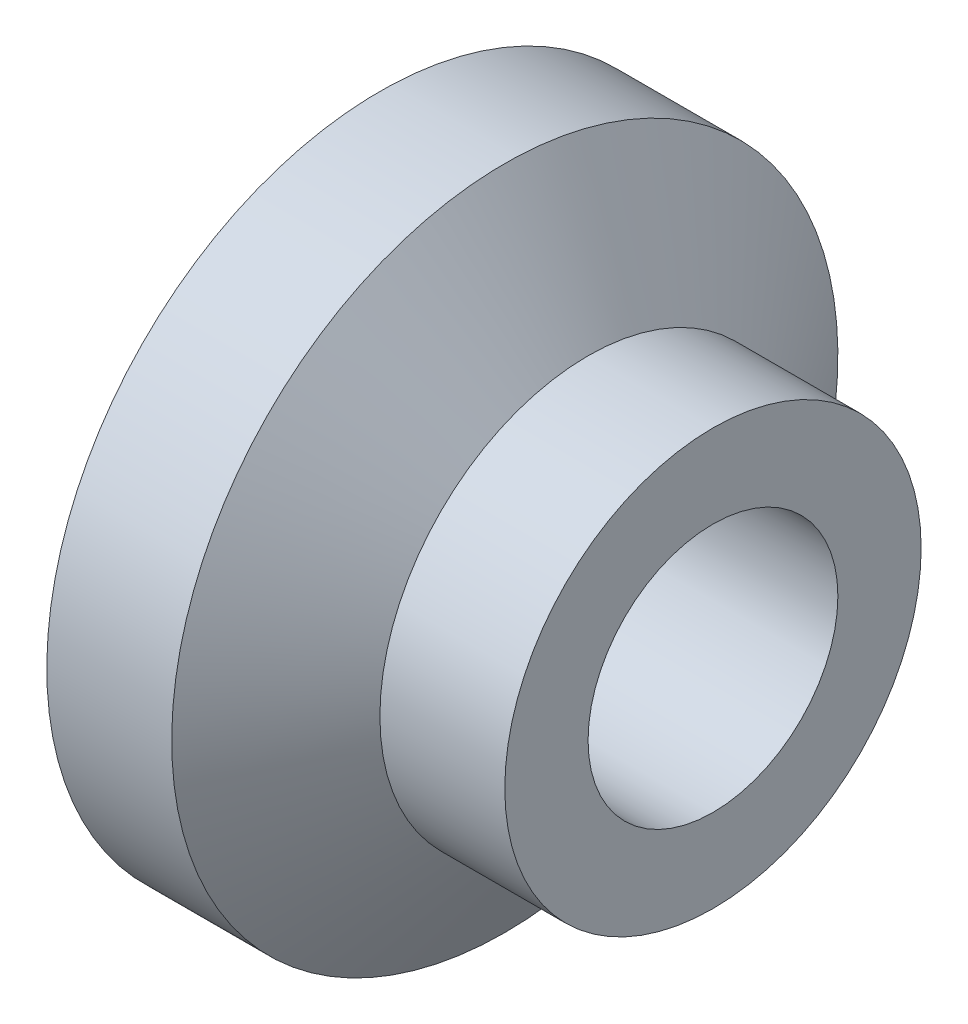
from build123d import *

# Parameters (mm, degrees)
ESQUISSE2_R             = 1.5
ENL_V_MAT_EXTRU_1_DEPTH = 7.92820323


with BuildPart() as part:
    # Esquisse1 → R_volution1 (revolve)
    with BuildSketch(Plane.XY, mode=Mode.PRIVATE) as r_volution1_sk:
        Polygon((0, 0), (0, 4), (1.5, 4), (2.5, 2.5), (4, 2.5), (4, 0), align=None)
    revolve(r_volution1_sk.sketch.rotate(Axis((-58.004217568, 0, 0), (1, 0, 0)), 180), axis=Axis((-58.004217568, 0, 0), (1, 0, 0)))

    # Esquisse2 → Enl_v. mat.-Extru.1 (cut, through all)
    with BuildSketch(Plane.ZY):
        with Locations(Location((0, 0, 0), (0, 0, 270))):
            Circle(ESQUISSE2_R)
    extrude(amount=-ENL_V_MAT_EXTRU_1_DEPTH, mode=Mode.SUBTRACT)


solid = part.part
